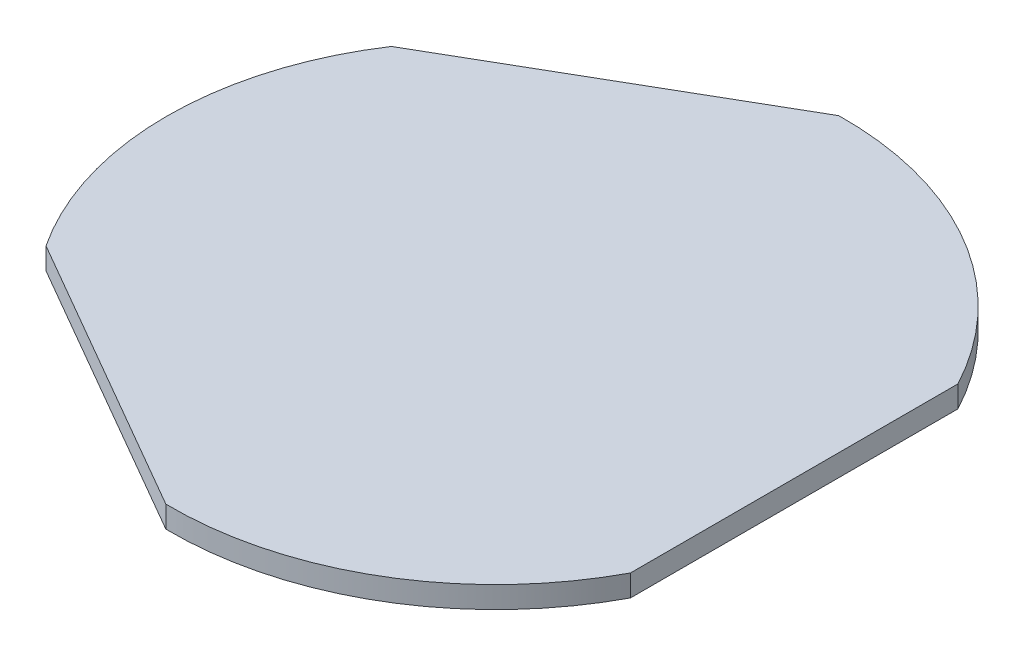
ISO-10303-21;
HEADER;
FILE_DESCRIPTION(('STEP AP214'),'2;1');
FILE_NAME('part.step','',(''),(''),'','','');
FILE_SCHEMA(('AUTOMOTIVE_DESIGN { 1 0 10303 214 1 1 1 1 }'));
ENDSEC;
DATA;
#1=APPLICATION_CONTEXT('core data for automotive mechanical design processes');
#2=APPLICATION_PROTOCOL_DEFINITION('international standard','automotive_design',2000,#1);
#3=PRODUCT_CONTEXT('',#1,'mechanical');
#4=PRODUCT('Part','Part','',(#3));
#5=PRODUCT_RELATED_PRODUCT_CATEGORY('part','',(#4));
#6=PRODUCT_DEFINITION_FORMATION('','',#4);
#7=PRODUCT_DEFINITION_CONTEXT('part definition',#1,'design');
#8=PRODUCT_DEFINITION('design','',#6,#7);
#9=PRODUCT_DEFINITION_SHAPE('','',#8);
#10=(LENGTH_UNIT() NAMED_UNIT(*) SI_UNIT(.MILLI.,.METRE.));
#11=(NAMED_UNIT(*) PLANE_ANGLE_UNIT() SI_UNIT($,.RADIAN.));
#12=(NAMED_UNIT(*) SI_UNIT($,.STERADIAN.) SOLID_ANGLE_UNIT());
#13=UNCERTAINTY_MEASURE_WITH_UNIT(LENGTH_MEASURE(1.E-05),#10,'distance_accuracy_value','');
#14=(GEOMETRIC_REPRESENTATION_CONTEXT(3) GLOBAL_UNCERTAINTY_ASSIGNED_CONTEXT((#13)) GLOBAL_UNIT_ASSIGNED_CONTEXT((#10,
#11,#12)) REPRESENTATION_CONTEXT('',''));
#15=CARTESIAN_POINT('',(0.,0.,0.));
#16=DIRECTION('',(0.,0.,1.));
#17=DIRECTION('',(1.,0.,0.));
#18=AXIS2_PLACEMENT_3D('',#15,#16,#17);
#19=CARTESIAN_POINT('',(-19.1175226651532,21.7620968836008,-0.474393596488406));
#20=DIRECTION('',(0.,-1.,0.));
#21=DIRECTION('',(0.,0.,-1.));
#22=AXIS2_PLACEMENT_3D('',#19,#20,#21);
#23=CYLINDRICAL_SURFACE('',#22,13.5);
#24=CARTESIAN_POINT('',(-19.1175226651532,-16.450605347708,-0.474393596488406));
#25=DIRECTION('',(0.,1.,0.));
#26=DIRECTION('',(0.,0.,1.));
#27=AXIS2_PLACEMENT_3D('',#24,#25,#26);
#28=CIRCLE('',#27,13.5);
#29=CARTESIAN_POINT('',(-7.19121964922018,-16.450605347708,-6.8));
#30=VERTEX_POINT('',#29);
#31=CARTESIAN_POINT('',(-19.314345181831,-16.450605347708,-13.9729587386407));
#32=VERTEX_POINT('',#31);
#33=EDGE_CURVE('E120',#30,#32,#28,.T.);
#34=ORIENTED_EDGE('',*,*,#33,.F.);
#35=DIRECTION('',(0.,-1.,0.));
#36=VECTOR('',#35,1.);
#37=CARTESIAN_POINT('',(-7.19121964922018,21.7620968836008,-6.8));
#38=LINE('',#37,#36);
#39=CARTESIAN_POINT('',(-7.19121964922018,-17.350605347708,-6.8));
#40=VERTEX_POINT('',#39);
#41=EDGE_CURVE('E43',#30,#40,#38,.T.);
#42=ORIENTED_EDGE('',*,*,#41,.T.);
#43=CARTESIAN_POINT('',(-19.1175226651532,-17.350605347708,-0.474393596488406));
#44=DIRECTION('',(0.,1.,0.));
#45=DIRECTION('',(0.,0.,1.));
#46=AXIS2_PLACEMENT_3D('',#43,#44,#45);
#47=CIRCLE('',#46,13.5);
#48=CARTESIAN_POINT('',(-19.314345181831,-17.350605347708,-13.9729587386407));
#49=VERTEX_POINT('',#48);
#50=EDGE_CURVE('E128',#40,#49,#47,.T.);
#51=ORIENTED_EDGE('',*,*,#50,.T.);
#52=DIRECTION('',(0.,-1.,0.));
#53=VECTOR('',#52,1.);
#54=CARTESIAN_POINT('',(-19.314345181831,21.7620968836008,-13.9729587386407));
#55=LINE('',#54,#53);
#56=EDGE_CURVE('E86',#32,#49,#55,.T.);
#57=ORIENTED_EDGE('',*,*,#56,.F.);
#58=EDGE_LOOP('',(#34,#42,#51,#57));
#59=FACE_BOUND('',#58,.T.);
#60=ADVANCED_FACE('F39',(#59),#23,.T.);
#61=CARTESIAN_POINT('',(-19.314345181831,21.7620968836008,-13.9729587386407));
#62=DIRECTION('',(0.5,0.,0.866025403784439));
#63=DIRECTION('',(0.866025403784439,0.,-0.5));
#64=AXIS2_PLACEMENT_3D('',#61,#62,#63);
#65=PLANE('',#64);
#66=DIRECTION('',(-0.866025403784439,0.,0.5));
#67=VECTOR('',#66,1.);
#68=CARTESIAN_POINT('',(-19.314345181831,-16.450605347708,-13.9729587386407));
#69=LINE('',#68,#67);
#70=CARTESIAN_POINT('',(-31.0922906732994,-16.450605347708,-7.17295873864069));
#71=VERTEX_POINT('',#70);
#72=EDGE_CURVE('E93',#32,#71,#69,.T.);
#73=ORIENTED_EDGE('',*,*,#72,.F.);
#74=ORIENTED_EDGE('',*,*,#56,.T.);
#75=DIRECTION('',(-0.866025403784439,0.,0.5));
#76=VECTOR('',#75,1.);
#77=CARTESIAN_POINT('',(-19.314345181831,-17.350605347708,-13.9729587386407));
#78=LINE('',#77,#76);
#79=CARTESIAN_POINT('',(-31.0922906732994,-17.350605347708,-7.17295873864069));
#80=VERTEX_POINT('',#79);
#81=EDGE_CURVE('E127',#49,#80,#78,.T.);
#82=ORIENTED_EDGE('',*,*,#81,.T.);
#83=DIRECTION('',(0.,-1.,0.));
#84=VECTOR('',#83,1.);
#85=CARTESIAN_POINT('',(-31.0922906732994,21.7620968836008,-7.17295873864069));
#86=LINE('',#85,#84);
#87=EDGE_CURVE('E129',#71,#80,#86,.T.);
#88=ORIENTED_EDGE('',*,*,#87,.F.);
#89=EDGE_LOOP('',(#73,#74,#82,#88));
#90=FACE_BOUND('',#89,.T.);
#91=ADVANCED_FACE('F147',(#90),#65,.F.);
#92=CARTESIAN_POINT('',(-20.2503045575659,21.7620968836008,0.));
#93=DIRECTION('',(0.,-1.,0.));
#94=DIRECTION('',(0.,0.,-1.));
#95=AXIS2_PLACEMENT_3D('',#92,#93,#94);
#96=CYLINDRICAL_SURFACE('',#95,13.);
#97=CARTESIAN_POINT('',(-20.2503045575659,-16.450605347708,0.));
#98=DIRECTION('',(0.,1.,0.));
#99=DIRECTION('',(0.,0.,1.));
#100=AXIS2_PLACEMENT_3D('',#97,#98,#99);
#101=CIRCLE('',#100,13.);
#102=CARTESIAN_POINT('',(-31.0922906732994,-16.450605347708,7.17295873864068));
#103=VERTEX_POINT('',#102);
#104=EDGE_CURVE('E114',#71,#103,#101,.T.);
#105=ORIENTED_EDGE('',*,*,#104,.F.);
#106=ORIENTED_EDGE('',*,*,#87,.T.);
#107=CARTESIAN_POINT('',(-20.2503045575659,-17.350605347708,0.));
#108=DIRECTION('',(0.,1.,0.));
#109=DIRECTION('',(0.,0.,1.));
#110=AXIS2_PLACEMENT_3D('',#107,#108,#109);
#111=CIRCLE('',#110,13.);
#112=CARTESIAN_POINT('',(-31.0922906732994,-17.350605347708,7.17295873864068));
#113=VERTEX_POINT('',#112);
#114=EDGE_CURVE('E131',#80,#113,#111,.T.);
#115=ORIENTED_EDGE('',*,*,#114,.T.);
#116=DIRECTION('',(0.,-1.,0.));
#117=VECTOR('',#116,1.);
#118=CARTESIAN_POINT('',(-31.0922906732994,21.7620968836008,7.17295873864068));
#119=LINE('',#118,#117);
#120=EDGE_CURVE('E132',#103,#113,#119,.T.);
#121=ORIENTED_EDGE('',*,*,#120,.F.);
#122=EDGE_LOOP('',(#105,#106,#115,#121));
#123=FACE_BOUND('',#122,.T.);
#124=ADVANCED_FACE('F149',(#123),#96,.T.);
#125=CARTESIAN_POINT('',(-31.0922906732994,21.7620968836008,7.17295873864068));
#126=DIRECTION('',(0.500000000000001,0.,-0.866025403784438));
#127=DIRECTION('',(-0.866025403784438,0.,-0.500000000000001));
#128=AXIS2_PLACEMENT_3D('',#125,#126,#127);
#129=PLANE('',#128);
#130=DIRECTION('',(0.866025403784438,0.,0.500000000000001));
#131=VECTOR('',#130,1.);
#132=CARTESIAN_POINT('',(-31.0922906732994,-16.450605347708,7.17295873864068));
#133=LINE('',#132,#131);
#134=CARTESIAN_POINT('',(-19.314345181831,-16.450605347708,13.9729587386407));
#135=VERTEX_POINT('',#134);
#136=EDGE_CURVE('E48',#103,#135,#133,.T.);
#137=ORIENTED_EDGE('',*,*,#136,.F.);
#138=ORIENTED_EDGE('',*,*,#120,.T.);
#139=DIRECTION('',(0.866025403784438,0.,0.5));
#140=VECTOR('',#139,1.);
#141=CARTESIAN_POINT('',(-31.0922906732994,-17.350605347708,7.17295873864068));
#142=LINE('',#141,#140);
#143=CARTESIAN_POINT('',(-19.314345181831,-17.350605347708,13.9729587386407));
#144=VERTEX_POINT('',#143);
#145=EDGE_CURVE('E109',#113,#144,#142,.T.);
#146=ORIENTED_EDGE('',*,*,#145,.T.);
#147=DIRECTION('',(0.,-1.,0.));
#148=VECTOR('',#147,1.);
#149=CARTESIAN_POINT('',(-19.314345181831,21.7620968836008,13.9729587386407));
#150=LINE('',#149,#148);
#151=EDGE_CURVE('E100',#135,#144,#150,.T.);
#152=ORIENTED_EDGE('',*,*,#151,.F.);
#153=EDGE_LOOP('',(#137,#138,#146,#152));
#154=FACE_BOUND('',#153,.T.);
#155=ADVANCED_FACE('F106',(#154),#129,.F.);
#156=CARTESIAN_POINT('',(-19.1175226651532,21.7620968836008,0.474393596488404));
#157=DIRECTION('',(0.,-1.,0.));
#158=DIRECTION('',(0.,0.,-1.));
#159=AXIS2_PLACEMENT_3D('',#156,#157,#158);
#160=CYLINDRICAL_SURFACE('',#159,13.5);
#161=CARTESIAN_POINT('',(-19.1175226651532,-16.450605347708,0.474393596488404));
#162=DIRECTION('',(0.,1.,0.));
#163=DIRECTION('',(0.,0.,1.));
#164=AXIS2_PLACEMENT_3D('',#161,#162,#163);
#165=CIRCLE('',#164,13.5);
#166=CARTESIAN_POINT('',(-7.19121964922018,-16.450605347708,6.8));
#167=VERTEX_POINT('',#166);
#168=EDGE_CURVE('E11',#135,#167,#165,.T.);
#169=ORIENTED_EDGE('',*,*,#168,.F.);
#170=ORIENTED_EDGE('',*,*,#151,.T.);
#171=CARTESIAN_POINT('',(-19.1175226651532,-17.350605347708,0.474393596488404));
#172=DIRECTION('',(0.,1.,0.));
#173=DIRECTION('',(0.,0.,1.));
#174=AXIS2_PLACEMENT_3D('',#171,#172,#173);
#175=CIRCLE('',#174,13.5);
#176=CARTESIAN_POINT('',(-7.19121964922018,-17.350605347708,6.8));
#177=VERTEX_POINT('',#176);
#178=EDGE_CURVE('E111',#144,#177,#175,.T.);
#179=ORIENTED_EDGE('',*,*,#178,.T.);
#180=DIRECTION('',(0.,-1.,0.));
#181=VECTOR('',#180,1.);
#182=CARTESIAN_POINT('',(-7.19121964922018,21.7620968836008,6.8));
#183=LINE('',#182,#181);
#184=EDGE_CURVE('E61',#167,#177,#183,.T.);
#185=ORIENTED_EDGE('',*,*,#184,.F.);
#186=EDGE_LOOP('',(#169,#170,#179,#185));
#187=FACE_BOUND('',#186,.T.);
#188=ADVANCED_FACE('F99',(#187),#160,.T.);
#189=CARTESIAN_POINT('',(-7.19121964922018,21.7620968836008,6.8));
#190=DIRECTION('',(-1.,0.,0.));
#191=DIRECTION('',(0.,0.,1.));
#192=AXIS2_PLACEMENT_3D('',#189,#190,#191);
#193=PLANE('',#192);
#194=DIRECTION('',(0.,0.,-1.));
#195=VECTOR('',#194,1.);
#196=CARTESIAN_POINT('',(-7.19121964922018,-16.450605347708,6.8));
#197=LINE('',#196,#195);
#198=EDGE_CURVE('E123',#167,#30,#197,.T.);
#199=ORIENTED_EDGE('',*,*,#198,.F.);
#200=ORIENTED_EDGE('',*,*,#184,.T.);
#201=DIRECTION('',(0.,0.,-1.));
#202=VECTOR('',#201,1.);
#203=CARTESIAN_POINT('',(-7.19121964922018,-17.350605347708,6.8));
#204=LINE('',#203,#202);
#205=EDGE_CURVE('E125',#177,#40,#204,.T.);
#206=ORIENTED_EDGE('',*,*,#205,.T.);
#207=ORIENTED_EDGE('',*,*,#41,.F.);
#208=EDGE_LOOP('',(#199,#200,#206,#207));
#209=FACE_BOUND('',#208,.T.);
#210=ADVANCED_FACE('F143',(#209),#193,.F.);
#211=CARTESIAN_POINT('',(-19.1175226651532,-17.350605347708,-0.474393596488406));
#212=DIRECTION('',(0.,1.,0.));
#213=DIRECTION('',(0.,0.,1.));
#214=AXIS2_PLACEMENT_3D('',#211,#212,#213);
#215=PLANE('',#214);
#216=ORIENTED_EDGE('',*,*,#50,.F.);
#217=ORIENTED_EDGE('',*,*,#205,.F.);
#218=ORIENTED_EDGE('',*,*,#178,.F.);
#219=ORIENTED_EDGE('',*,*,#145,.F.);
#220=ORIENTED_EDGE('',*,*,#114,.F.);
#221=ORIENTED_EDGE('',*,*,#81,.F.);
#222=EDGE_LOOP('',(#216,#217,#218,#219,#220,#221));
#223=FACE_BOUND('',#222,.T.);
#224=ADVANCED_FACE('F145',(#223),#215,.F.);
#225=CARTESIAN_POINT('',(-19.5662196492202,-16.450605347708,0.));
#226=DIRECTION('',(0.,1.,0.));
#227=DIRECTION('',(0.,0.,1.));
#228=AXIS2_PLACEMENT_3D('',#225,#226,#227);
#229=PLANE('',#228);
#230=ORIENTED_EDGE('',*,*,#198,.T.);
#231=ORIENTED_EDGE('',*,*,#33,.T.);
#232=ORIENTED_EDGE('',*,*,#72,.T.);
#233=ORIENTED_EDGE('',*,*,#104,.T.);
#234=ORIENTED_EDGE('',*,*,#136,.T.);
#235=ORIENTED_EDGE('',*,*,#168,.T.);
#236=EDGE_LOOP('',(#230,#231,#232,#233,#234,#235));
#237=FACE_BOUND('',#236,.T.);
#238=ADVANCED_FACE('F41',(#237),#229,.T.);
#239=CLOSED_SHELL('',(#60,#91,#124,#155,#188,#210,#224,#238));
#240=MANIFOLD_SOLID_BREP('B2',#239);
#241=ADVANCED_BREP_SHAPE_REPRESENTATION('',(#18,#240),#14);
#242=SHAPE_DEFINITION_REPRESENTATION(#9,#241);
ENDSEC;
END-ISO-10303-21;
